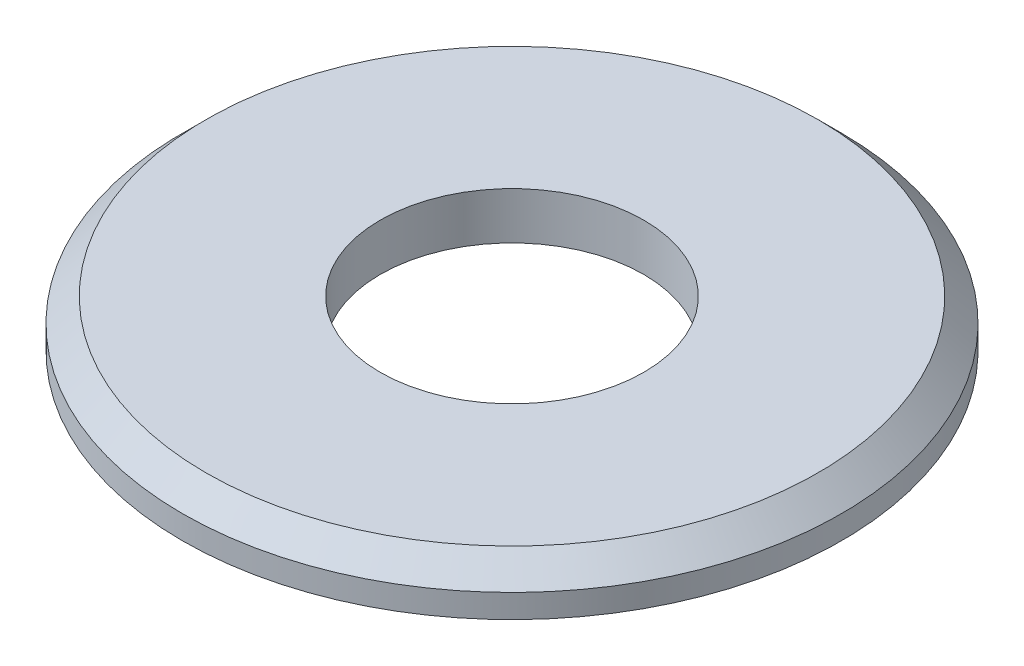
ISO-10303-21;
HEADER;
FILE_DESCRIPTION(('STEP AP214'),'2;1');
FILE_NAME('part.step','',(''),(''),'','','');
FILE_SCHEMA(('AUTOMOTIVE_DESIGN { 1 0 10303 214 1 1 1 1 }'));
ENDSEC;
DATA;
#1=APPLICATION_CONTEXT('core data for automotive mechanical design processes');
#2=APPLICATION_PROTOCOL_DEFINITION('international standard','automotive_design',2000,#1);
#3=PRODUCT_CONTEXT('',#1,'mechanical');
#4=PRODUCT('Part','Part','',(#3));
#5=PRODUCT_RELATED_PRODUCT_CATEGORY('part','',(#4));
#6=PRODUCT_DEFINITION_FORMATION('','',#4);
#7=PRODUCT_DEFINITION_CONTEXT('part definition',#1,'design');
#8=PRODUCT_DEFINITION('design','',#6,#7);
#9=PRODUCT_DEFINITION_SHAPE('','',#8);
#10=(LENGTH_UNIT() NAMED_UNIT(*) SI_UNIT(.MILLI.,.METRE.));
#11=(NAMED_UNIT(*) PLANE_ANGLE_UNIT() SI_UNIT($,.RADIAN.));
#12=(NAMED_UNIT(*) SI_UNIT($,.STERADIAN.) SOLID_ANGLE_UNIT());
#13=UNCERTAINTY_MEASURE_WITH_UNIT(LENGTH_MEASURE(1.E-05),#10,'distance_accuracy_value','');
#14=(GEOMETRIC_REPRESENTATION_CONTEXT(3) GLOBAL_UNCERTAINTY_ASSIGNED_CONTEXT((#13)) GLOBAL_UNIT_ASSIGNED_CONTEXT((#10,
#11,#12)) REPRESENTATION_CONTEXT('',''));
#15=CARTESIAN_POINT('',(0.,0.,0.));
#16=DIRECTION('',(0.,0.,1.));
#17=DIRECTION('',(1.,0.,0.));
#18=AXIS2_PLACEMENT_3D('',#15,#16,#17);
#19=CARTESIAN_POINT('',(0.,0.5,0.));
#20=DIRECTION('',(0.,1.,0.));
#21=DIRECTION('',(0.,0.,1.));
#22=AXIS2_PLACEMENT_3D('',#19,#20,#21);
#23=PLANE('',#22);
#24=CARTESIAN_POINT('',(0.,0.5,0.));
#25=DIRECTION('',(0.,1.,0.));
#26=DIRECTION('',(0.,0.,1.));
#27=AXIS2_PLACEMENT_3D('',#24,#25,#26);
#28=CIRCLE('',#27,3.25);
#29=CARTESIAN_POINT('',(0.,0.5,3.25));
#30=VERTEX_POINT('',#29);
#31=EDGE_CURVE('E35',#30,#30,#28,.T.);
#32=ORIENTED_EDGE('',*,*,#31,.T.);
#33=EDGE_LOOP('',(#32));
#34=FACE_BOUND('',#33,.T.);
#35=CARTESIAN_POINT('',(0.,0.5,0.));
#36=DIRECTION('',(0.,1.,0.));
#37=DIRECTION('',(0.,0.,1.));
#38=AXIS2_PLACEMENT_3D('',#35,#36,#37);
#39=CIRCLE('',#38,1.4);
#40=CARTESIAN_POINT('',(0.,0.5,1.4));
#41=VERTEX_POINT('',#40);
#42=EDGE_CURVE('E43',#41,#41,#39,.T.);
#43=ORIENTED_EDGE('',*,*,#42,.F.);
#44=EDGE_LOOP('',(#43));
#45=FACE_BOUND('',#44,.T.);
#46=ADVANCED_FACE('F28',(#34,#45),#23,.T.);
#47=CARTESIAN_POINT('',(0.,0.,0.));
#48=DIRECTION('',(0.,1.,0.));
#49=DIRECTION('',(0.,0.,1.));
#50=AXIS2_PLACEMENT_3D('',#47,#48,#49);
#51=PLANE('',#50);
#52=CARTESIAN_POINT('',(0.,0.,0.));
#53=DIRECTION('',(0.,1.,0.));
#54=DIRECTION('',(0.,0.,1.));
#55=AXIS2_PLACEMENT_3D('',#52,#53,#54);
#56=CIRCLE('',#55,3.5);
#57=CARTESIAN_POINT('',(0.,0.,3.5));
#58=VERTEX_POINT('',#57);
#59=EDGE_CURVE('E39',#58,#58,#56,.T.);
#60=ORIENTED_EDGE('',*,*,#59,.F.);
#61=EDGE_LOOP('',(#60));
#62=FACE_BOUND('',#61,.T.);
#63=CARTESIAN_POINT('',(0.,0.,0.));
#64=DIRECTION('',(0.,1.,0.));
#65=DIRECTION('',(0.,0.,1.));
#66=AXIS2_PLACEMENT_3D('',#63,#64,#65);
#67=CIRCLE('',#66,1.4);
#68=CARTESIAN_POINT('',(0.,0.,1.4));
#69=VERTEX_POINT('',#68);
#70=EDGE_CURVE('E48',#69,#69,#67,.T.);
#71=ORIENTED_EDGE('',*,*,#70,.T.);
#72=EDGE_LOOP('',(#71));
#73=FACE_BOUND('',#72,.T.);
#74=ADVANCED_FACE('F52',(#62,#73),#51,.F.);
#75=CARTESIAN_POINT('',(0.,0.5,0.));
#76=DIRECTION('',(0.,-1.,0.));
#77=DIRECTION('',(0.,0.,-1.));
#78=AXIS2_PLACEMENT_3D('',#75,#76,#77);
#79=CYLINDRICAL_SURFACE('',#78,3.5);
#80=CARTESIAN_POINT('',(0.,0.25,0.));
#81=DIRECTION('',(0.,1.,0.));
#82=DIRECTION('',(0.,0.,1.));
#83=AXIS2_PLACEMENT_3D('',#80,#81,#82);
#84=CIRCLE('',#83,3.5);
#85=CARTESIAN_POINT('',(0.,0.25,3.5));
#86=VERTEX_POINT('',#85);
#87=EDGE_CURVE('E10',#86,#86,#84,.F.);
#88=ORIENTED_EDGE('',*,*,#87,.T.);
#89=EDGE_LOOP('',(#88));
#90=FACE_BOUND('',#89,.T.);
#91=ORIENTED_EDGE('',*,*,#59,.T.);
#92=EDGE_LOOP('',(#91));
#93=FACE_BOUND('',#92,.T.);
#94=ADVANCED_FACE('F30',(#90,#93),#79,.T.);
#95=CARTESIAN_POINT('',(0.,0.5,0.));
#96=DIRECTION('',(0.,-1.,0.));
#97=DIRECTION('',(0.,0.,-1.));
#98=AXIS2_PLACEMENT_3D('',#95,#96,#97);
#99=CYLINDRICAL_SURFACE('',#98,1.4);
#100=ORIENTED_EDGE('',*,*,#42,.T.);
#101=EDGE_LOOP('',(#100));
#102=FACE_BOUND('',#101,.T.);
#103=ORIENTED_EDGE('',*,*,#70,.F.);
#104=EDGE_LOOP('',(#103));
#105=FACE_BOUND('',#104,.T.);
#106=ADVANCED_FACE('F54',(#102,#105),#99,.F.);
#107=CARTESIAN_POINT('',(0.,0.5,0.));
#108=DIRECTION('',(0.,-1.,0.));
#109=DIRECTION('',(0.,0.,-1.));
#110=AXIS2_PLACEMENT_3D('',#107,#108,#109);
#111=CONICAL_SURFACE('',#110,3.25,0.785398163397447);
#112=ORIENTED_EDGE('',*,*,#87,.F.);
#113=EDGE_LOOP('',(#112));
#114=FACE_BOUND('',#113,.T.);
#115=ORIENTED_EDGE('',*,*,#31,.F.);
#116=EDGE_LOOP('',(#115));
#117=FACE_BOUND('',#116,.T.);
#118=ADVANCED_FACE('F56',(#114,#117),#111,.T.);
#119=CLOSED_SHELL('',(#46,#74,#94,#106,#118));
#120=MANIFOLD_SOLID_BREP('B2',#119);
#121=ADVANCED_BREP_SHAPE_REPRESENTATION('',(#18,#120),#14);
#122=SHAPE_DEFINITION_REPRESENTATION(#9,#121);
ENDSEC;
END-ISO-10303-21;
